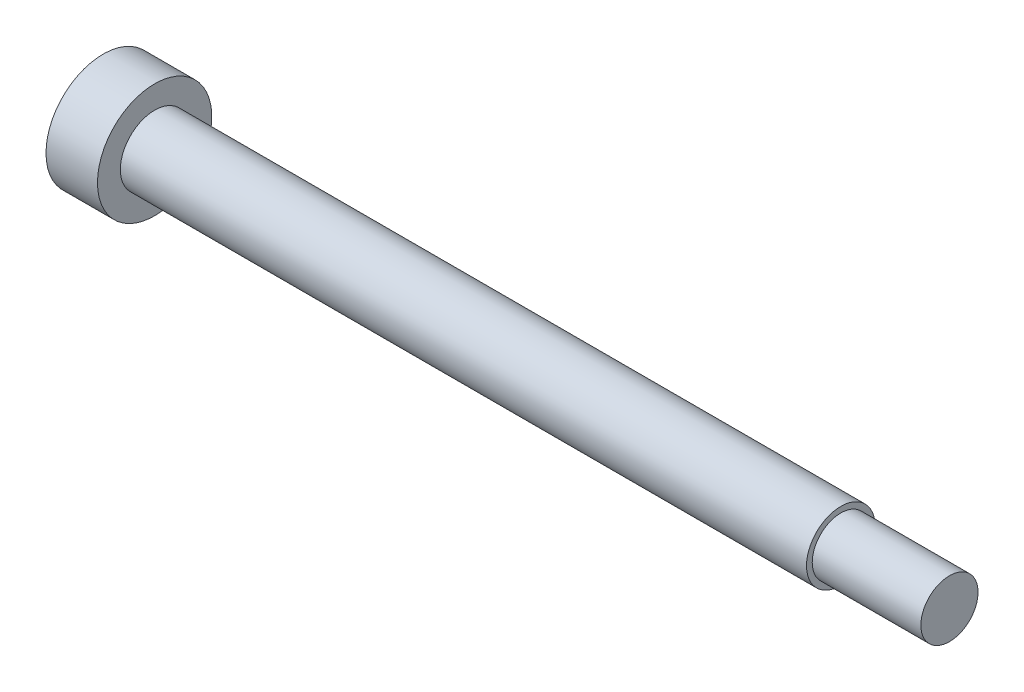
ISO-10303-21;
HEADER;
FILE_DESCRIPTION(('STEP AP214'),'2;1');
FILE_NAME('part.step','',(''),(''),'','','');
FILE_SCHEMA(('AUTOMOTIVE_DESIGN { 1 0 10303 214 1 1 1 1 }'));
ENDSEC;
DATA;
#1=APPLICATION_CONTEXT('core data for automotive mechanical design processes');
#2=APPLICATION_PROTOCOL_DEFINITION('international standard','automotive_design',2000,#1);
#3=PRODUCT_CONTEXT('',#1,'mechanical');
#4=PRODUCT('Part','Part','',(#3));
#5=PRODUCT_RELATED_PRODUCT_CATEGORY('part','',(#4));
#6=PRODUCT_DEFINITION_FORMATION('','',#4);
#7=PRODUCT_DEFINITION_CONTEXT('part definition',#1,'design');
#8=PRODUCT_DEFINITION('design','',#6,#7);
#9=PRODUCT_DEFINITION_SHAPE('','',#8);
#10=(LENGTH_UNIT() NAMED_UNIT(*) SI_UNIT(.MILLI.,.METRE.));
#11=(NAMED_UNIT(*) PLANE_ANGLE_UNIT() SI_UNIT($,.RADIAN.));
#12=(NAMED_UNIT(*) SI_UNIT($,.STERADIAN.) SOLID_ANGLE_UNIT());
#13=UNCERTAINTY_MEASURE_WITH_UNIT(LENGTH_MEASURE(1.E-05),#10,'distance_accuracy_value','');
#14=(GEOMETRIC_REPRESENTATION_CONTEXT(3) GLOBAL_UNCERTAINTY_ASSIGNED_CONTEXT((#13)) GLOBAL_UNIT_ASSIGNED_CONTEXT((#10,
#11,#12)) REPRESENTATION_CONTEXT('',''));
#15=CARTESIAN_POINT('',(0.,0.,0.));
#16=DIRECTION('',(0.,0.,1.));
#17=DIRECTION('',(1.,0.,0.));
#18=AXIS2_PLACEMENT_3D('',#15,#16,#17);
#19=CARTESIAN_POINT('',(0.,0.,0.));
#20=DIRECTION('',(1.,0.,0.));
#21=DIRECTION('',(0.,0.,-1.));
#22=AXIS2_PLACEMENT_3D('',#19,#20,#21);
#23=PLANE('',#22);
#24=DIRECTION('',(0.,0.866025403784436,-0.5));
#25=VECTOR('',#24,1.);
#26=CARTESIAN_POINT('',(0.,0.,2.));
#27=LINE('',#26,#25);
#28=CARTESIAN_POINT('',(0.,0.,2.));
#29=VERTEX_POINT('',#28);
#30=CARTESIAN_POINT('',(0.,1.73205080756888,1.));
#31=VERTEX_POINT('',#30);
#32=EDGE_CURVE('E104',#29,#31,#27,.T.);
#33=ORIENTED_EDGE('',*,*,#32,.F.);
#34=DIRECTION('',(0.,0.866025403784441,0.5));
#35=VECTOR('',#34,1.);
#36=CARTESIAN_POINT('',(0.,-1.73205080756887,1.));
#37=LINE('',#36,#35);
#38=CARTESIAN_POINT('',(0.,-1.73205080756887,1.));
#39=VERTEX_POINT('',#38);
#40=EDGE_CURVE('E30',#39,#29,#37,.T.);
#41=ORIENTED_EDGE('',*,*,#40,.F.);
#42=DIRECTION('',(0.,0.,1.));
#43=VECTOR('',#42,1.);
#44=CARTESIAN_POINT('',(0.,-1.73205080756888,-1.));
#45=LINE('',#44,#43);
#46=CARTESIAN_POINT('',(0.,-1.73205080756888,-1.));
#47=VERTEX_POINT('',#46);
#48=EDGE_CURVE('E113',#47,#39,#45,.T.);
#49=ORIENTED_EDGE('',*,*,#48,.F.);
#50=DIRECTION('',(0.,-0.866025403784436,0.5));
#51=VECTOR('',#50,1.);
#52=CARTESIAN_POINT('',(0.,0.,-2.));
#53=LINE('',#52,#51);
#54=CARTESIAN_POINT('',(0.,0.,-2.));
#55=VERTEX_POINT('',#54);
#56=EDGE_CURVE('E111',#55,#47,#53,.T.);
#57=ORIENTED_EDGE('',*,*,#56,.F.);
#58=DIRECTION('',(0.,-0.866025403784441,-0.5));
#59=VECTOR('',#58,1.);
#60=CARTESIAN_POINT('',(0.,1.73205080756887,-1.));
#61=LINE('',#60,#59);
#62=CARTESIAN_POINT('',(0.,1.73205080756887,-1.));
#63=VERTEX_POINT('',#62);
#64=EDGE_CURVE('E78',#63,#55,#61,.T.);
#65=ORIENTED_EDGE('',*,*,#64,.F.);
#66=DIRECTION('',(0.,0.,-1.));
#67=VECTOR('',#66,1.);
#68=CARTESIAN_POINT('',(0.,1.73205080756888,1.));
#69=LINE('',#68,#67);
#70=EDGE_CURVE('E107',#31,#63,#69,.T.);
#71=ORIENTED_EDGE('',*,*,#70,.F.);
#72=EDGE_LOOP('',(#33,#41,#49,#57,#65,#71));
#73=FACE_BOUND('',#72,.T.);
#74=CARTESIAN_POINT('',(0.,0.,0.));
#75=DIRECTION('',(-1.,0.,0.));
#76=DIRECTION('',(0.,0.,1.));
#77=AXIS2_PLACEMENT_3D('',#74,#75,#76);
#78=CIRCLE('',#77,5.);
#79=CARTESIAN_POINT('',(0.,0.,5.));
#80=VERTEX_POINT('',#79);
#81=EDGE_CURVE('E10',#80,#80,#78,.T.);
#82=ORIENTED_EDGE('',*,*,#81,.T.);
#83=EDGE_LOOP('',(#82));
#84=FACE_BOUND('',#83,.T.);
#85=ADVANCED_FACE('F16',(#73,#84),#23,.F.);
#86=CARTESIAN_POINT('',(0.,0.,0.));
#87=DIRECTION('',(-1.,0.,0.));
#88=DIRECTION('',(0.,0.,1.));
#89=AXIS2_PLACEMENT_3D('',#86,#87,#88);
#90=CYLINDRICAL_SURFACE('',#89,5.);
#91=ORIENTED_EDGE('',*,*,#81,.F.);
#92=EDGE_LOOP('',(#91));
#93=FACE_BOUND('',#92,.T.);
#94=CARTESIAN_POINT('',(4.5,0.,0.));
#95=DIRECTION('',(-1.,0.,0.));
#96=DIRECTION('',(0.,0.,1.));
#97=AXIS2_PLACEMENT_3D('',#94,#95,#96);
#98=CIRCLE('',#97,5.);
#99=CARTESIAN_POINT('',(4.5,0.,5.));
#100=VERTEX_POINT('',#99);
#101=EDGE_CURVE('E23',#100,#100,#98,.T.);
#102=ORIENTED_EDGE('',*,*,#101,.T.);
#103=EDGE_LOOP('',(#102));
#104=FACE_BOUND('',#103,.T.);
#105=ADVANCED_FACE('F136',(#93,#104),#90,.T.);
#106=CARTESIAN_POINT('',(4.5,5.,0.));
#107=DIRECTION('',(-1.,0.,0.));
#108=DIRECTION('',(0.,0.,1.));
#109=AXIS2_PLACEMENT_3D('',#106,#107,#108);
#110=PLANE('',#109);
#111=ORIENTED_EDGE('',*,*,#101,.F.);
#112=EDGE_LOOP('',(#111));
#113=FACE_BOUND('',#112,.T.);
#114=CARTESIAN_POINT('',(4.5,0.,0.));
#115=DIRECTION('',(-1.,0.,0.));
#116=DIRECTION('',(0.,0.,1.));
#117=AXIS2_PLACEMENT_3D('',#114,#115,#116);
#118=CIRCLE('',#117,3.);
#119=CARTESIAN_POINT('',(4.5,0.,3.));
#120=VERTEX_POINT('',#119);
#121=EDGE_CURVE('E131',#120,#120,#118,.T.);
#122=ORIENTED_EDGE('',*,*,#121,.T.);
#123=EDGE_LOOP('',(#122));
#124=FACE_BOUND('',#123,.T.);
#125=ADVANCED_FACE('F138',(#113,#124),#110,.F.);
#126=CARTESIAN_POINT('',(0.,0.,0.));
#127=DIRECTION('',(-1.,0.,0.));
#128=DIRECTION('',(0.,0.,1.));
#129=AXIS2_PLACEMENT_3D('',#126,#127,#128);
#130=CYLINDRICAL_SURFACE('',#129,3.);
#131=ORIENTED_EDGE('',*,*,#121,.F.);
#132=EDGE_LOOP('',(#131));
#133=FACE_BOUND('',#132,.T.);
#134=CARTESIAN_POINT('',(64.5,0.,0.));
#135=DIRECTION('',(-1.,0.,0.));
#136=DIRECTION('',(0.,0.,1.));
#137=AXIS2_PLACEMENT_3D('',#134,#135,#136);
#138=CIRCLE('',#137,3.);
#139=CARTESIAN_POINT('',(64.5,0.,3.));
#140=VERTEX_POINT('',#139);
#141=EDGE_CURVE('E128',#140,#140,#138,.T.);
#142=ORIENTED_EDGE('',*,*,#141,.T.);
#143=EDGE_LOOP('',(#142));
#144=FACE_BOUND('',#143,.T.);
#145=ADVANCED_FACE('F141',(#133,#144),#130,.T.);
#146=CARTESIAN_POINT('',(64.5,3.,0.));
#147=DIRECTION('',(-1.,0.,0.));
#148=DIRECTION('',(0.,0.,1.));
#149=AXIS2_PLACEMENT_3D('',#146,#147,#148);
#150=PLANE('',#149);
#151=ORIENTED_EDGE('',*,*,#141,.F.);
#152=EDGE_LOOP('',(#151));
#153=FACE_BOUND('',#152,.T.);
#154=CARTESIAN_POINT('',(64.5,0.,0.));
#155=DIRECTION('',(-1.,0.,0.));
#156=DIRECTION('',(0.,0.,1.));
#157=AXIS2_PLACEMENT_3D('',#154,#155,#156);
#158=CIRCLE('',#157,2.5);
#159=CARTESIAN_POINT('',(64.5,0.,2.5));
#160=VERTEX_POINT('',#159);
#161=EDGE_CURVE('E125',#160,#160,#158,.T.);
#162=ORIENTED_EDGE('',*,*,#161,.T.);
#163=EDGE_LOOP('',(#162));
#164=FACE_BOUND('',#163,.T.);
#165=ADVANCED_FACE('F147',(#153,#164),#150,.F.);
#166=CARTESIAN_POINT('',(0.,0.,0.));
#167=DIRECTION('',(-1.,0.,0.));
#168=DIRECTION('',(0.,0.,1.));
#169=AXIS2_PLACEMENT_3D('',#166,#167,#168);
#170=CYLINDRICAL_SURFACE('',#169,2.5);
#171=ORIENTED_EDGE('',*,*,#161,.F.);
#172=EDGE_LOOP('',(#171));
#173=FACE_BOUND('',#172,.T.);
#174=CARTESIAN_POINT('',(74.,0.,0.));
#175=DIRECTION('',(-1.,0.,0.));
#176=DIRECTION('',(0.,0.,1.));
#177=AXIS2_PLACEMENT_3D('',#174,#175,#176);
#178=CIRCLE('',#177,2.5);
#179=CARTESIAN_POINT('',(74.,0.,2.5));
#180=VERTEX_POINT('',#179);
#181=EDGE_CURVE('E117',#180,#180,#178,.T.);
#182=ORIENTED_EDGE('',*,*,#181,.T.);
#183=EDGE_LOOP('',(#182));
#184=FACE_BOUND('',#183,.T.);
#185=ADVANCED_FACE('F153',(#173,#184),#170,.T.);
#186=CARTESIAN_POINT('',(74.,2.5,0.));
#187=DIRECTION('',(-1.,0.,0.));
#188=DIRECTION('',(0.,0.,1.));
#189=AXIS2_PLACEMENT_3D('',#186,#187,#188);
#190=PLANE('',#189);
#191=ORIENTED_EDGE('',*,*,#181,.F.);
#192=EDGE_LOOP('',(#191));
#193=FACE_BOUND('',#192,.T.);
#194=ADVANCED_FACE('F159',(#193),#190,.F.);
#195=CARTESIAN_POINT('',(3.,-1.73205080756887,1.));
#196=DIRECTION('',(0.,-0.5,0.866025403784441));
#197=DIRECTION('',(0.,-0.866025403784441,-0.5));
#198=AXIS2_PLACEMENT_3D('',#195,#196,#197);
#199=PLANE('',#198);
#200=ORIENTED_EDGE('',*,*,#40,.T.);
#201=DIRECTION('',(-1.,0.,0.));
#202=VECTOR('',#201,1.);
#203=CARTESIAN_POINT('',(3.,0.,2.));
#204=LINE('',#203,#202);
#205=CARTESIAN_POINT('',(3.,0.,2.));
#206=VERTEX_POINT('',#205);
#207=EDGE_CURVE('E60',#206,#29,#204,.T.);
#208=ORIENTED_EDGE('',*,*,#207,.F.);
#209=DIRECTION('',(0.,0.866025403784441,0.5));
#210=VECTOR('',#209,1.);
#211=CARTESIAN_POINT('',(3.,-1.73205080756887,1.));
#212=LINE('',#211,#210);
#213=CARTESIAN_POINT('',(3.,-1.73205080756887,1.));
#214=VERTEX_POINT('',#213);
#215=EDGE_CURVE('E115',#214,#206,#212,.T.);
#216=ORIENTED_EDGE('',*,*,#215,.F.);
#217=DIRECTION('',(-1.,0.,0.));
#218=VECTOR('',#217,1.);
#219=CARTESIAN_POINT('',(3.,-1.73205080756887,1.));
#220=LINE('',#219,#218);
#221=EDGE_CURVE('E38',#214,#39,#220,.T.);
#222=ORIENTED_EDGE('',*,*,#221,.T.);
#223=EDGE_LOOP('',(#200,#208,#216,#222));
#224=FACE_BOUND('',#223,.T.);
#225=ADVANCED_FACE('F164',(#224),#199,.F.);
#226=CARTESIAN_POINT('',(3.,-1.73205080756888,-1.));
#227=DIRECTION('',(0.,-1.,0.));
#228=DIRECTION('',(0.,0.,-1.));
#229=AXIS2_PLACEMENT_3D('',#226,#227,#228);
#230=PLANE('',#229);
#231=ORIENTED_EDGE('',*,*,#48,.T.);
#232=ORIENTED_EDGE('',*,*,#221,.F.);
#233=DIRECTION('',(0.,0.,1.));
#234=VECTOR('',#233,1.);
#235=CARTESIAN_POINT('',(3.,-1.73205080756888,-1.));
#236=LINE('',#235,#234);
#237=CARTESIAN_POINT('',(3.,-1.73205080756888,-1.));
#238=VERTEX_POINT('',#237);
#239=EDGE_CURVE('E90',#238,#214,#236,.T.);
#240=ORIENTED_EDGE('',*,*,#239,.F.);
#241=DIRECTION('',(-1.,0.,0.));
#242=VECTOR('',#241,1.);
#243=CARTESIAN_POINT('',(3.,-1.73205080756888,-1.));
#244=LINE('',#243,#242);
#245=EDGE_CURVE('E82',#238,#47,#244,.T.);
#246=ORIENTED_EDGE('',*,*,#245,.T.);
#247=EDGE_LOOP('',(#231,#232,#240,#246));
#248=FACE_BOUND('',#247,.T.);
#249=ADVANCED_FACE('F171',(#248),#230,.F.);
#250=CARTESIAN_POINT('',(3.,0.,-2.));
#251=DIRECTION('',(0.,-0.5,-0.866025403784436));
#252=DIRECTION('',(0.,0.866025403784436,-0.5));
#253=AXIS2_PLACEMENT_3D('',#250,#251,#252);
#254=PLANE('',#253);
#255=ORIENTED_EDGE('',*,*,#56,.T.);
#256=ORIENTED_EDGE('',*,*,#245,.F.);
#257=DIRECTION('',(0.,-0.866025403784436,0.5));
#258=VECTOR('',#257,1.);
#259=CARTESIAN_POINT('',(3.,0.,-2.));
#260=LINE('',#259,#258);
#261=CARTESIAN_POINT('',(3.,0.,-2.));
#262=VERTEX_POINT('',#261);
#263=EDGE_CURVE('E86',#262,#238,#260,.T.);
#264=ORIENTED_EDGE('',*,*,#263,.F.);
#265=DIRECTION('',(-1.,0.,0.));
#266=VECTOR('',#265,1.);
#267=CARTESIAN_POINT('',(3.,0.,-2.));
#268=LINE('',#267,#266);
#269=EDGE_CURVE('E71',#262,#55,#268,.T.);
#270=ORIENTED_EDGE('',*,*,#269,.T.);
#271=EDGE_LOOP('',(#255,#256,#264,#270));
#272=FACE_BOUND('',#271,.T.);
#273=ADVANCED_FACE('F87',(#272),#254,.F.);
#274=CARTESIAN_POINT('',(3.,1.73205080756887,-1.));
#275=DIRECTION('',(0.,0.5,-0.866025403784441));
#276=DIRECTION('',(0.,0.866025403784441,0.5));
#277=AXIS2_PLACEMENT_3D('',#274,#275,#276);
#278=PLANE('',#277);
#279=ORIENTED_EDGE('',*,*,#64,.T.);
#280=ORIENTED_EDGE('',*,*,#269,.F.);
#281=DIRECTION('',(0.,-0.866025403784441,-0.5));
#282=VECTOR('',#281,1.);
#283=CARTESIAN_POINT('',(3.,1.73205080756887,-1.));
#284=LINE('',#283,#282);
#285=CARTESIAN_POINT('',(3.,1.73205080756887,-1.));
#286=VERTEX_POINT('',#285);
#287=EDGE_CURVE('E75',#286,#262,#284,.T.);
#288=ORIENTED_EDGE('',*,*,#287,.F.);
#289=DIRECTION('',(-1.,0.,0.));
#290=VECTOR('',#289,1.);
#291=CARTESIAN_POINT('',(3.,1.73205080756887,-1.));
#292=LINE('',#291,#290);
#293=EDGE_CURVE('E83',#286,#63,#292,.T.);
#294=ORIENTED_EDGE('',*,*,#293,.T.);
#295=EDGE_LOOP('',(#279,#280,#288,#294));
#296=FACE_BOUND('',#295,.T.);
#297=ADVANCED_FACE('F73',(#296),#278,.F.);
#298=CARTESIAN_POINT('',(3.,1.73205080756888,1.));
#299=DIRECTION('',(0.,1.,0.));
#300=DIRECTION('',(0.,0.,1.));
#301=AXIS2_PLACEMENT_3D('',#298,#299,#300);
#302=PLANE('',#301);
#303=ORIENTED_EDGE('',*,*,#70,.T.);
#304=ORIENTED_EDGE('',*,*,#293,.F.);
#305=DIRECTION('',(0.,0.,-1.));
#306=VECTOR('',#305,1.);
#307=CARTESIAN_POINT('',(3.,1.73205080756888,1.));
#308=LINE('',#307,#306);
#309=CARTESIAN_POINT('',(3.,1.73205080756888,1.));
#310=VERTEX_POINT('',#309);
#311=EDGE_CURVE('E96',#310,#286,#308,.T.);
#312=ORIENTED_EDGE('',*,*,#311,.F.);
#313=DIRECTION('',(-1.,0.,0.));
#314=VECTOR('',#313,1.);
#315=CARTESIAN_POINT('',(3.,1.73205080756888,1.));
#316=LINE('',#315,#314);
#317=EDGE_CURVE('E120',#310,#31,#316,.T.);
#318=ORIENTED_EDGE('',*,*,#317,.T.);
#319=EDGE_LOOP('',(#303,#304,#312,#318));
#320=FACE_BOUND('',#319,.T.);
#321=ADVANCED_FACE('F199',(#320),#302,.F.);
#322=CARTESIAN_POINT('',(3.,0.,2.));
#323=DIRECTION('',(0.,0.5,0.866025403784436));
#324=DIRECTION('',(0.,-0.866025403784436,0.5));
#325=AXIS2_PLACEMENT_3D('',#322,#323,#324);
#326=PLANE('',#325);
#327=ORIENTED_EDGE('',*,*,#32,.T.);
#328=ORIENTED_EDGE('',*,*,#317,.F.);
#329=DIRECTION('',(0.,0.866025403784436,-0.5));
#330=VECTOR('',#329,1.);
#331=CARTESIAN_POINT('',(3.,0.,2.));
#332=LINE('',#331,#330);
#333=EDGE_CURVE('E98',#206,#310,#332,.T.);
#334=ORIENTED_EDGE('',*,*,#333,.F.);
#335=ORIENTED_EDGE('',*,*,#207,.T.);
#336=EDGE_LOOP('',(#327,#328,#334,#335));
#337=FACE_BOUND('',#336,.T.);
#338=ADVANCED_FACE('F186',(#337),#326,.F.);
#339=CARTESIAN_POINT('',(3.,0.,0.));
#340=DIRECTION('',(-1.,0.,0.));
#341=DIRECTION('',(0.,0.,1.));
#342=AXIS2_PLACEMENT_3D('',#339,#340,#341);
#343=PLANE('',#342);
#344=ORIENTED_EDGE('',*,*,#215,.T.);
#345=ORIENTED_EDGE('',*,*,#333,.T.);
#346=ORIENTED_EDGE('',*,*,#311,.T.);
#347=ORIENTED_EDGE('',*,*,#287,.T.);
#348=ORIENTED_EDGE('',*,*,#263,.T.);
#349=ORIENTED_EDGE('',*,*,#239,.T.);
#350=EDGE_LOOP('',(#344,#345,#346,#347,#348,#349));
#351=FACE_BOUND('',#350,.T.);
#352=ADVANCED_FACE('F93',(#351),#343,.T.);
#353=CLOSED_SHELL('',(#85,#105,#125,#145,#165,#185,#194,#225,#249,#273,#297,#321,#338,#352));
#354=MANIFOLD_SOLID_BREP('B1',#353);
#355=ADVANCED_BREP_SHAPE_REPRESENTATION('',(#18,#354),#14);
#356=SHAPE_DEFINITION_REPRESENTATION(#9,#355);
ENDSEC;
END-ISO-10303-21;
